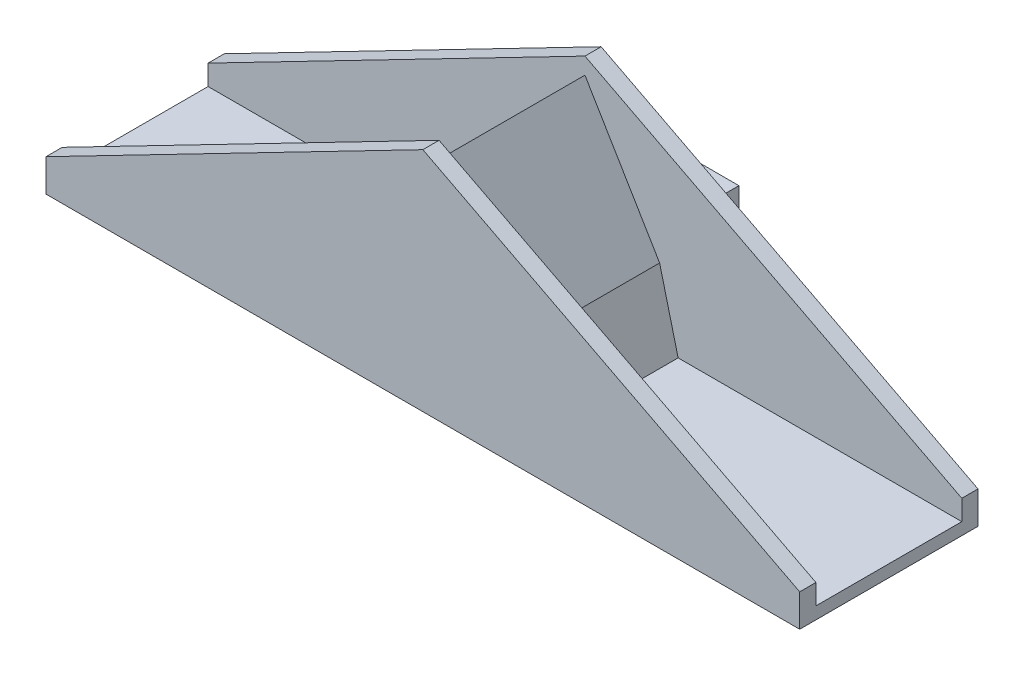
ISO-10303-21;
HEADER;
FILE_DESCRIPTION(('STEP AP214'),'2;1');
FILE_NAME('part.step','',(''),(''),'','','');
FILE_SCHEMA(('AUTOMOTIVE_DESIGN { 1 0 10303 214 1 1 1 1 }'));
ENDSEC;
DATA;
#1=APPLICATION_CONTEXT('core data for automotive mechanical design processes');
#2=APPLICATION_PROTOCOL_DEFINITION('international standard','automotive_design',2000,#1);
#3=PRODUCT_CONTEXT('',#1,'mechanical');
#4=PRODUCT('Part','Part','',(#3));
#5=PRODUCT_RELATED_PRODUCT_CATEGORY('part','',(#4));
#6=PRODUCT_DEFINITION_FORMATION('','',#4);
#7=PRODUCT_DEFINITION_CONTEXT('part definition',#1,'design');
#8=PRODUCT_DEFINITION('design','',#6,#7);
#9=PRODUCT_DEFINITION_SHAPE('','',#8);
#10=(LENGTH_UNIT() NAMED_UNIT(*) SI_UNIT(.MILLI.,.METRE.));
#11=(NAMED_UNIT(*) PLANE_ANGLE_UNIT() SI_UNIT($,.RADIAN.));
#12=(NAMED_UNIT(*) SI_UNIT($,.STERADIAN.) SOLID_ANGLE_UNIT());
#13=UNCERTAINTY_MEASURE_WITH_UNIT(LENGTH_MEASURE(1.E-05),#10,'distance_accuracy_value','');
#14=(GEOMETRIC_REPRESENTATION_CONTEXT(3) GLOBAL_UNCERTAINTY_ASSIGNED_CONTEXT((#13)) GLOBAL_UNIT_ASSIGNED_CONTEXT((#10,
#11,#12)) REPRESENTATION_CONTEXT('',''));
#15=CARTESIAN_POINT('',(0.,0.,0.));
#16=DIRECTION('',(0.,0.,1.));
#17=DIRECTION('',(1.,0.,0.));
#18=AXIS2_PLACEMENT_3D('',#15,#16,#17);
#19=CARTESIAN_POINT('',(26.7708980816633,7.03937851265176,-21.));
#20=DIRECTION('',(-1.,0.,0.));
#21=DIRECTION('',(0.,0.,1.));
#22=AXIS2_PLACEMENT_3D('',#19,#20,#21);
#23=CYLINDRICAL_SURFACE('',#22,1.);
#24=DIRECTION('',(-1.,0.,0.));
#25=VECTOR('',#24,1.);
#26=CARTESIAN_POINT('',(0.,7.03937851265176,-20.));
#27=LINE('',#26,#25);
#28=CARTESIAN_POINT('',(24.7708980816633,7.03937851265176,-20.));
#29=VERTEX_POINT('',#28);
#30=CARTESIAN_POINT('',(27.7708980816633,7.03937851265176,-20.));
#31=VERTEX_POINT('',#30);
#32=EDGE_CURVE('E303',#29,#31,#27,.F.);
#33=ORIENTED_EDGE('',*,*,#32,.F.);
#34=CARTESIAN_POINT('',(24.7708980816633,7.03937851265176,-21.));
#35=DIRECTION('',(1.,0.,0.));
#36=DIRECTION('',(0.,0.,-1.));
#37=AXIS2_PLACEMENT_3D('',#34,#35,#36);
#38=CIRCLE('',#37,1.);
#39=CARTESIAN_POINT('',(24.7708980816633,8.03937851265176,-21.));
#40=VERTEX_POINT('',#39);
#41=EDGE_CURVE('E11',#29,#40,#38,.F.);
#42=ORIENTED_EDGE('',*,*,#41,.T.);
#43=DIRECTION('',(-1.,0.,0.));
#44=VECTOR('',#43,1.);
#45=CARTESIAN_POINT('',(26.7708980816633,8.03937851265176,-21.));
#46=LINE('',#45,#44);
#47=CARTESIAN_POINT('',(26.7708980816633,8.03937851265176,-21.));
#48=VERTEX_POINT('',#47);
#49=EDGE_CURVE('E310',#48,#40,#46,.T.);
#50=ORIENTED_EDGE('',*,*,#49,.F.);
#51=CARTESIAN_POINT('',(27.7708980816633,7.03937851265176,-21.));
#52=DIRECTION('',(-0.707106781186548,-0.707106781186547,0.));
#53=DIRECTION('',(0.707106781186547,-0.707106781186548,0.));
#54=AXIS2_PLACEMENT_3D('',#51,#52,#53);
#55=ELLIPSE('',#54,1.41421356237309,1.);
#56=EDGE_CURVE('E321',#48,#31,#55,.F.);
#57=ORIENTED_EDGE('',*,*,#56,.T.);
#58=EDGE_LOOP('',(#33,#42,#50,#57));
#59=FACE_BOUND('',#58,.T.);
#60=ADVANCED_FACE('F34',(#59),#23,.F.);
#61=CARTESIAN_POINT('',(0.,0.,-20.));
#62=DIRECTION('',(0.,0.,-1.));
#63=DIRECTION('',(-1.,0.,0.));
#64=AXIS2_PLACEMENT_3D('',#61,#62,#63);
#65=PLANE('',#64);
#66=DIRECTION('',(1.,0.,0.));
#67=VECTOR('',#66,1.);
#68=CARTESIAN_POINT('',(26.7708980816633,16.0393785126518,-20.));
#69=LINE('',#68,#67);
#70=CARTESIAN_POINT('',(24.7708980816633,16.0393785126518,-20.));
#71=VERTEX_POINT('',#70);
#72=CARTESIAN_POINT('',(27.7708980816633,16.0393785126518,-20.));
#73=VERTEX_POINT('',#72);
#74=EDGE_CURVE('E324',#71,#73,#69,.T.);
#75=ORIENTED_EDGE('',*,*,#74,.F.);
#76=DIRECTION('',(0.,1.,0.));
#77=VECTOR('',#76,1.);
#78=CARTESIAN_POINT('',(24.7708980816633,7.03937851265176,-20.));
#79=LINE('',#78,#77);
#80=EDGE_CURVE('E57',#29,#71,#79,.T.);
#81=ORIENTED_EDGE('',*,*,#80,.F.);
#82=ORIENTED_EDGE('',*,*,#32,.T.);
#83=DIRECTION('',(0.,-1.,0.));
#84=VECTOR('',#83,1.);
#85=CARTESIAN_POINT('',(27.7708980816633,0.,-20.));
#86=LINE('',#85,#84);
#87=EDGE_CURVE('E306',#31,#73,#86,.F.);
#88=ORIENTED_EDGE('',*,*,#87,.T.);
#89=EDGE_LOOP('',(#75,#81,#82,#88));
#90=FACE_BOUND('',#89,.T.);
#91=DIRECTION('',(0.,-1.,0.));
#92=VECTOR('',#91,1.);
#93=CARTESIAN_POINT('',(-33.7291019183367,-2.61627906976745,-20.));
#94=LINE('',#93,#92);
#95=CARTESIAN_POINT('',(-33.7291019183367,1.38372093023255,-20.));
#96=VERTEX_POINT('',#95);
#97=CARTESIAN_POINT('',(-33.7291019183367,-2.61627906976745,-20.));
#98=VERTEX_POINT('',#97);
#99=EDGE_CURVE('E350',#96,#98,#94,.T.);
#100=ORIENTED_EDGE('',*,*,#99,.F.);
#101=DIRECTION('',(-0.888620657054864,-0.458642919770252,0.));
#102=VECTOR('',#101,1.);
#103=CARTESIAN_POINT('',(-33.7291019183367,1.38372093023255,-20.));
#104=LINE('',#103,#102);
#105=CARTESIAN_POINT('',(12.7708980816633,25.3837209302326,-20.));
#106=VERTEX_POINT('',#105);
#107=EDGE_CURVE('E355',#106,#96,#104,.T.);
#108=ORIENTED_EDGE('',*,*,#107,.F.);
#109=DIRECTION('',(-0.888620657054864,0.458642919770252,0.));
#110=VECTOR('',#109,1.);
#111=CARTESIAN_POINT('',(59.2708980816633,1.38372093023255,-20.));
#112=LINE('',#111,#110);
#113=CARTESIAN_POINT('',(59.2708980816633,1.38372093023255,-20.));
#114=VERTEX_POINT('',#113);
#115=EDGE_CURVE('E373',#114,#106,#112,.T.);
#116=ORIENTED_EDGE('',*,*,#115,.F.);
#117=DIRECTION('',(0.,1.,0.));
#118=VECTOR('',#117,1.);
#119=CARTESIAN_POINT('',(59.2708980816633,-2.61627906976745,-20.));
#120=LINE('',#119,#118);
#121=CARTESIAN_POINT('',(59.2708980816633,-2.61627906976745,-20.));
#122=VERTEX_POINT('',#121);
#123=EDGE_CURVE('E371',#122,#114,#120,.T.);
#124=ORIENTED_EDGE('',*,*,#123,.F.);
#125=DIRECTION('',(1.,0.,0.));
#126=VECTOR('',#125,1.);
#127=CARTESIAN_POINT('',(-33.7291019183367,-2.61627906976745,-20.));
#128=LINE('',#127,#126);
#129=EDGE_CURVE('E368',#98,#122,#128,.T.);
#130=ORIENTED_EDGE('',*,*,#129,.F.);
#131=EDGE_LOOP('',(#100,#108,#116,#124,#130));
#132=FACE_BOUND('',#131,.T.);
#133=CARTESIAN_POINT('',(16.7708980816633,16.0393785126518,-20.));
#134=VERTEX_POINT('',#133);
#135=CARTESIAN_POINT('',(19.7708980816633,16.0393785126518,-20.));
#136=VERTEX_POINT('',#135);
#137=EDGE_CURVE('E329',#134,#136,#69,.T.);
#138=ORIENTED_EDGE('',*,*,#137,.F.);
#139=DIRECTION('',(0.,1.,0.));
#140=VECTOR('',#139,1.);
#141=CARTESIAN_POINT('',(16.7708980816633,0.,-20.));
#142=LINE('',#141,#140);
#143=CARTESIAN_POINT('',(16.7708980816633,7.03937851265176,-20.));
#144=VERTEX_POINT('',#143);
#145=EDGE_CURVE('E302',#134,#144,#142,.F.);
#146=ORIENTED_EDGE('',*,*,#145,.T.);
#147=CARTESIAN_POINT('',(19.7708980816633,7.03937851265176,-20.));
#148=VERTEX_POINT('',#147);
#149=EDGE_CURVE('E296',#144,#148,#27,.F.);
#150=ORIENTED_EDGE('',*,*,#149,.T.);
#151=DIRECTION('',(0.,1.,0.));
#152=VECTOR('',#151,1.);
#153=CARTESIAN_POINT('',(19.7708980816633,7.03937851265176,-20.));
#154=LINE('',#153,#152);
#155=EDGE_CURVE('E280',#148,#136,#154,.T.);
#156=ORIENTED_EDGE('',*,*,#155,.T.);
#157=EDGE_LOOP('',(#138,#146,#150,#156));
#158=FACE_BOUND('',#157,.T.);
#159=ADVANCED_FACE('F300',(#90,#132,#158),#65,.T.);
#160=CARTESIAN_POINT('',(-33.7291019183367,-2.61627906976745,2.));
#161=DIRECTION('',(0.,1.,0.));
#162=DIRECTION('',(0.,0.,1.));
#163=AXIS2_PLACEMENT_3D('',#160,#161,#162);
#164=PLANE('',#163);
#165=DIRECTION('',(0.,0.,1.));
#166=VECTOR('',#165,1.);
#167=CARTESIAN_POINT('',(12.2708980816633,-2.61627906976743,-9.));
#168=LINE('',#167,#166);
#169=CARTESIAN_POINT('',(12.2708980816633,-2.61627906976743,-18.));
#170=VERTEX_POINT('',#169);
#171=CARTESIAN_POINT('',(12.2708980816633,-2.61627906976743,0.));
#172=VERTEX_POINT('',#171);
#173=EDGE_CURVE('E468',#170,#172,#168,.T.);
#174=ORIENTED_EDGE('',*,*,#173,.F.);
#175=DIRECTION('',(1.,0.,0.));
#176=VECTOR('',#175,1.);
#177=CARTESIAN_POINT('',(-33.7291019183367,-2.61627906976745,-18.));
#178=LINE('',#177,#176);
#179=CARTESIAN_POINT('',(1.22750170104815,-2.61627906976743,-18.));
#180=VERTEX_POINT('',#179);
#181=EDGE_CURVE('E358',#180,#170,#178,.T.);
#182=ORIENTED_EDGE('',*,*,#181,.F.);
#183=DIRECTION('',(0.,0.,-1.));
#184=VECTOR('',#183,1.);
#185=CARTESIAN_POINT('',(1.2275017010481,-2.61627906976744,0.));
#186=LINE('',#185,#184);
#187=CARTESIAN_POINT('',(1.2275017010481,-2.61627906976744,0.));
#188=VERTEX_POINT('',#187);
#189=EDGE_CURVE('E488',#188,#180,#186,.T.);
#190=ORIENTED_EDGE('',*,*,#189,.F.);
#191=DIRECTION('',(-1.,0.,0.));
#192=VECTOR('',#191,1.);
#193=CARTESIAN_POINT('',(1.2275017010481,-2.61627906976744,0.));
#194=LINE('',#193,#192);
#195=EDGE_CURVE('E481',#172,#188,#194,.T.);
#196=ORIENTED_EDGE('',*,*,#195,.F.);
#197=EDGE_LOOP('',(#174,#182,#190,#196));
#198=FACE_BOUND('',#197,.T.);
#199=DIRECTION('',(0.,0.,-1.));
#200=VECTOR('',#199,1.);
#201=CARTESIAN_POINT('',(-33.7291019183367,-2.61627906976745,2.));
#202=LINE('',#201,#200);
#203=CARTESIAN_POINT('',(-33.7291019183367,-2.61627906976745,2.));
#204=VERTEX_POINT('',#203);
#205=EDGE_CURVE('E555',#204,#98,#202,.T.);
#206=ORIENTED_EDGE('',*,*,#205,.T.);
#207=ORIENTED_EDGE('',*,*,#129,.T.);
#208=DIRECTION('',(0.,0.,-1.));
#209=VECTOR('',#208,1.);
#210=CARTESIAN_POINT('',(59.2708980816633,-2.61627906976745,2.));
#211=LINE('',#210,#209);
#212=CARTESIAN_POINT('',(59.2708980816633,-2.61627906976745,2.));
#213=VERTEX_POINT('',#212);
#214=EDGE_CURVE('E553',#213,#122,#211,.T.);
#215=ORIENTED_EDGE('',*,*,#214,.F.);
#216=DIRECTION('',(1.,0.,0.));
#217=VECTOR('',#216,1.);
#218=CARTESIAN_POINT('',(-33.7291019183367,-2.61627906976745,2.));
#219=LINE('',#218,#217);
#220=EDGE_CURVE('E528',#204,#213,#219,.T.);
#221=ORIENTED_EDGE('',*,*,#220,.F.);
#222=EDGE_LOOP('',(#206,#207,#215,#221));
#223=FACE_BOUND('',#222,.T.);
#224=DIRECTION('',(0.,0.,-1.));
#225=VECTOR('',#224,1.);
#226=CARTESIAN_POINT('',(24.3142944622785,-2.61627906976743,0.));
#227=LINE('',#226,#225);
#228=CARTESIAN_POINT('',(24.3142944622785,-2.61627906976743,0.));
#229=VERTEX_POINT('',#228);
#230=CARTESIAN_POINT('',(24.3142944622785,-2.61627906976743,-18.));
#231=VERTEX_POINT('',#230);
#232=EDGE_CURVE('E487',#229,#231,#227,.T.);
#233=ORIENTED_EDGE('',*,*,#232,.T.);
#234=CARTESIAN_POINT('',(13.2708980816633,-2.61627906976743,-18.));
#235=VERTEX_POINT('',#234);
#236=EDGE_CURVE('E354',#235,#231,#178,.T.);
#237=ORIENTED_EDGE('',*,*,#236,.F.);
#238=DIRECTION('',(0.,0.,1.));
#239=VECTOR('',#238,1.);
#240=CARTESIAN_POINT('',(13.2708980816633,-2.61627906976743,-9.));
#241=LINE('',#240,#239);
#242=CARTESIAN_POINT('',(13.2708980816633,-2.61627906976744,0.));
#243=VERTEX_POINT('',#242);
#244=EDGE_CURVE('E471',#235,#243,#241,.T.);
#245=ORIENTED_EDGE('',*,*,#244,.T.);
#246=EDGE_CURVE('E482',#229,#243,#194,.T.);
#247=ORIENTED_EDGE('',*,*,#246,.F.);
#248=EDGE_LOOP('',(#233,#237,#245,#247));
#249=FACE_BOUND('',#248,.T.);
#250=ADVANCED_FACE('F606',(#198,#223,#249),#164,.F.);
#251=CARTESIAN_POINT('',(59.2708980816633,-1.11627906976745,-9.));
#252=DIRECTION('',(0.,-1.,0.));
#253=DIRECTION('',(0.,0.,-1.));
#254=AXIS2_PLACEMENT_3D('',#251,#252,#253);
#255=PLANE('',#254);
#256=DIRECTION('',(1.,0.,0.));
#257=VECTOR('',#256,1.);
#258=CARTESIAN_POINT('',(59.2708980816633,-1.11627906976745,-18.));
#259=LINE('',#258,#257);
#260=CARTESIAN_POINT('',(24.2708980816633,-1.11627906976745,-18.));
#261=VERTEX_POINT('',#260);
#262=CARTESIAN_POINT('',(59.2708980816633,-1.11627906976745,-18.));
#263=VERTEX_POINT('',#262);
#264=EDGE_CURVE('E425',#261,#263,#259,.T.);
#265=ORIENTED_EDGE('',*,*,#264,.F.);
#266=DIRECTION('',(0.,0.,1.));
#267=VECTOR('',#266,1.);
#268=CARTESIAN_POINT('',(24.2708980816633,-1.11627906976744,-9.));
#269=LINE('',#268,#267);
#270=CARTESIAN_POINT('',(24.2708980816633,-1.11627906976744,0.));
#271=VERTEX_POINT('',#270);
#272=EDGE_CURVE('E500',#261,#271,#269,.T.);
#273=ORIENTED_EDGE('',*,*,#272,.T.);
#274=DIRECTION('',(1.,0.,0.));
#275=VECTOR('',#274,1.);
#276=CARTESIAN_POINT('',(59.2708980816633,-1.11627906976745,0.));
#277=LINE('',#276,#275);
#278=CARTESIAN_POINT('',(59.2708980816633,-1.11627906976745,0.));
#279=VERTEX_POINT('',#278);
#280=EDGE_CURVE('E514',#271,#279,#277,.T.);
#281=ORIENTED_EDGE('',*,*,#280,.T.);
#282=DIRECTION('',(0.,0.,1.));
#283=VECTOR('',#282,1.);
#284=CARTESIAN_POINT('',(59.2708980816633,-1.11627906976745,-9.));
#285=LINE('',#284,#283);
#286=EDGE_CURVE('E518',#263,#279,#285,.T.);
#287=ORIENTED_EDGE('',*,*,#286,.F.);
#288=EDGE_LOOP('',(#265,#273,#281,#287));
#289=FACE_BOUND('',#288,.T.);
#290=ADVANCED_FACE('F705',(#289),#255,.F.);
#291=CARTESIAN_POINT('',(12.7708980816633,4.38372093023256,0.));
#292=DIRECTION('',(0.518518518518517,0.855066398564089,0.));
#293=DIRECTION('',(-0.85506639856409,0.518518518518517,0.));
#294=AXIS2_PLACEMENT_3D('',#291,#292,#293);
#295=PLANE('',#294);
#296=DIRECTION('',(0.,0.,1.));
#297=VECTOR('',#296,1.);
#298=CARTESIAN_POINT('',(13.7293815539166,3.80248954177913,0.));
#299=LINE('',#298,#297);
#300=CARTESIAN_POINT('',(13.7293815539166,3.80248954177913,-18.));
#301=VERTEX_POINT('',#300);
#302=CARTESIAN_POINT('',(13.7293815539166,3.80248954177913,0.));
#303=VERTEX_POINT('',#302);
#304=EDGE_CURVE('E474',#301,#303,#299,.T.);
#305=ORIENTED_EDGE('',*,*,#304,.F.);
#306=DIRECTION('',(0.85506639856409,-0.518518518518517,0.));
#307=VECTOR('',#306,1.);
#308=CARTESIAN_POINT('',(12.7708980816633,4.38372093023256,-18.));
#309=LINE('',#308,#307);
#310=EDGE_CURVE('E408',#301,#231,#309,.T.);
#311=ORIENTED_EDGE('',*,*,#310,.T.);
#312=ORIENTED_EDGE('',*,*,#232,.F.);
#313=DIRECTION('',(0.85506639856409,-0.518518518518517,0.));
#314=VECTOR('',#313,1.);
#315=CARTESIAN_POINT('',(12.7708980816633,4.38372093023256,0.));
#316=LINE('',#315,#314);
#317=EDGE_CURVE('E479',#303,#229,#316,.T.);
#318=ORIENTED_EDGE('',*,*,#317,.F.);
#319=EDGE_LOOP('',(#305,#311,#312,#318));
#320=FACE_BOUND('',#319,.T.);
#321=ADVANCED_FACE('F701',(#320),#295,.F.);
#322=CARTESIAN_POINT('',(12.7708980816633,4.38372093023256,0.));
#323=DIRECTION('',(-0.518518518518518,0.855066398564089,0.));
#324=DIRECTION('',(-0.855066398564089,-0.518518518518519,0.));
#325=AXIS2_PLACEMENT_3D('',#322,#323,#324);
#326=PLANE('',#325);
#327=DIRECTION('',(0.855066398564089,0.518518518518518,0.));
#328=VECTOR('',#327,1.);
#329=CARTESIAN_POINT('',(12.7708980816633,4.38372093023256,-18.));
#330=LINE('',#329,#328);
#331=CARTESIAN_POINT('',(11.81241460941,3.80248954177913,-18.));
#332=VERTEX_POINT('',#331);
#333=EDGE_CURVE('E410',#180,#332,#330,.T.);
#334=ORIENTED_EDGE('',*,*,#333,.T.);
#335=DIRECTION('',(0.,0.,-1.));
#336=VECTOR('',#335,1.);
#337=CARTESIAN_POINT('',(11.81241460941,3.80248954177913,0.));
#338=LINE('',#337,#336);
#339=CARTESIAN_POINT('',(11.81241460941,3.80248954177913,0.));
#340=VERTEX_POINT('',#339);
#341=EDGE_CURVE('E477',#340,#332,#338,.T.);
#342=ORIENTED_EDGE('',*,*,#341,.F.);
#343=DIRECTION('',(0.855066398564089,0.518518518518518,0.));
#344=VECTOR('',#343,1.);
#345=CARTESIAN_POINT('',(12.7708980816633,4.38372093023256,0.));
#346=LINE('',#345,#344);
#347=EDGE_CURVE('E484',#188,#340,#346,.T.);
#348=ORIENTED_EDGE('',*,*,#347,.F.);
#349=ORIENTED_EDGE('',*,*,#189,.T.);
#350=EDGE_LOOP('',(#334,#342,#348,#349));
#351=FACE_BOUND('',#350,.T.);
#352=ADVANCED_FACE('F697',(#351),#326,.F.);
#353=CARTESIAN_POINT('',(0.,0.,0.));
#354=DIRECTION('',(0.,0.,-1.));
#355=DIRECTION('',(-1.,0.,0.));
#356=AXIS2_PLACEMENT_3D('',#353,#354,#355);
#357=PLANE('',#356);
#358=ORIENTED_EDGE('',*,*,#347,.T.);
#359=DIRECTION('',(-0.0712470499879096,0.997458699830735,0.));
#360=VECTOR('',#359,1.);
#361=CARTESIAN_POINT('',(12.2708980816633,-2.61627906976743,0.));
#362=LINE('',#361,#360);
#363=EDGE_CURVE('E451',#172,#340,#362,.T.);
#364=ORIENTED_EDGE('',*,*,#363,.F.);
#365=ORIENTED_EDGE('',*,*,#195,.T.);
#366=EDGE_LOOP('',(#358,#364,#365));
#367=FACE_BOUND('',#366,.T.);
#368=ADVANCED_FACE('F693',(#367),#357,.T.);
#369=ORIENTED_EDGE('',*,*,#246,.T.);
#370=DIRECTION('',(0.0712470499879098,0.997458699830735,0.));
#371=VECTOR('',#370,1.);
#372=CARTESIAN_POINT('',(13.3894615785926,-0.956390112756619,0.));
#373=LINE('',#372,#371);
#374=EDGE_CURVE('E557',#243,#303,#373,.T.);
#375=ORIENTED_EDGE('',*,*,#374,.T.);
#376=ORIENTED_EDGE('',*,*,#317,.T.);
#377=EDGE_LOOP('',(#369,#375,#376));
#378=FACE_BOUND('',#377,.T.);
#379=ADVANCED_FACE('F696',(#378),#357,.T.);
#380=CARTESIAN_POINT('',(0.,0.,0.));
#381=DIRECTION('',(0.,0.,-1.));
#382=DIRECTION('',(-1.,0.,0.));
#383=AXIS2_PLACEMENT_3D('',#380,#381,#382);
#384=PLANE('',#383);
#385=DIRECTION('',(0.51195101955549,0.859014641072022,0.));
#386=VECTOR('',#385,1.);
#387=CARTESIAN_POINT('',(3.55577972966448,7.88372093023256,0.));
#388=LINE('',#387,#386);
#389=CARTESIAN_POINT('',(3.55577972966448,7.88372093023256,0.));
#390=VERTEX_POINT('',#389);
#391=CARTESIAN_POINT('',(12.7708980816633,23.345984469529,0.));
#392=VERTEX_POINT('',#391);
#393=EDGE_CURVE('E494',#390,#392,#388,.T.);
#394=ORIENTED_EDGE('',*,*,#393,.F.);
#395=DIRECTION('',(0.246069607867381,0.969252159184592,0.));
#396=VECTOR('',#395,1.);
#397=CARTESIAN_POINT('',(1.27089808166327,-1.11627906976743,0.));
#398=LINE('',#397,#396);
#399=CARTESIAN_POINT('',(1.27089808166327,-1.11627906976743,0.));
#400=VERTEX_POINT('',#399);
#401=EDGE_CURVE('E490',#400,#390,#398,.T.);
#402=ORIENTED_EDGE('',*,*,#401,.F.);
#403=CARTESIAN_POINT('',(-33.7291019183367,-1.11627906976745,0.));
#404=VERTEX_POINT('',#403);
#405=EDGE_CURVE('E515',#404,#400,#277,.T.);
#406=ORIENTED_EDGE('',*,*,#405,.F.);
#407=DIRECTION('',(0.,-1.,0.));
#408=VECTOR('',#407,1.);
#409=CARTESIAN_POINT('',(-33.7291019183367,-2.61627906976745,0.));
#410=LINE('',#409,#408);
#411=CARTESIAN_POINT('',(-33.7291019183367,1.38372093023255,0.));
#412=VERTEX_POINT('',#411);
#413=EDGE_CURVE('E524',#412,#404,#410,.T.);
#414=ORIENTED_EDGE('',*,*,#413,.F.);
#415=DIRECTION('',(-0.888620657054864,-0.458642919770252,0.));
#416=VECTOR('',#415,1.);
#417=CARTESIAN_POINT('',(-33.7291019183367,1.38372093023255,0.));
#418=LINE('',#417,#416);
#419=CARTESIAN_POINT('',(12.7708980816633,25.3837209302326,0.));
#420=VERTEX_POINT('',#419);
#421=EDGE_CURVE('E529',#420,#412,#418,.T.);
#422=ORIENTED_EDGE('',*,*,#421,.F.);
#423=DIRECTION('',(-0.888620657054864,0.458642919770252,0.));
#424=VECTOR('',#423,1.);
#425=CARTESIAN_POINT('',(59.2708980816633,1.38372093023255,0.));
#426=LINE('',#425,#424);
#427=CARTESIAN_POINT('',(59.2708980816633,1.38372093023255,0.));
#428=VERTEX_POINT('',#427);
#429=EDGE_CURVE('E542',#428,#420,#426,.T.);
#430=ORIENTED_EDGE('',*,*,#429,.F.);
#431=DIRECTION('',(0.,1.,0.));
#432=VECTOR('',#431,1.);
#433=CARTESIAN_POINT('',(59.2708980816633,-2.61627906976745,0.));
#434=LINE('',#433,#432);
#435=EDGE_CURVE('E540',#279,#428,#434,.T.);
#436=ORIENTED_EDGE('',*,*,#435,.F.);
#437=ORIENTED_EDGE('',*,*,#280,.F.);
#438=DIRECTION('',(0.246069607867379,-0.969252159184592,0.));
#439=VECTOR('',#438,1.);
#440=CARTESIAN_POINT('',(24.2708980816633,-1.11627906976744,0.));
#441=LINE('',#440,#439);
#442=CARTESIAN_POINT('',(21.9860164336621,7.88372093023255,0.));
#443=VERTEX_POINT('',#442);
#444=EDGE_CURVE('E498',#443,#271,#441,.T.);
#445=ORIENTED_EDGE('',*,*,#444,.F.);
#446=DIRECTION('',(0.511951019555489,-0.859014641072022,0.));
#447=VECTOR('',#446,1.);
#448=CARTESIAN_POINT('',(21.9860164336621,7.88372093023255,0.));
#449=LINE('',#448,#447);
#450=EDGE_CURVE('E496',#392,#443,#449,.T.);
#451=ORIENTED_EDGE('',*,*,#450,.F.);
#452=EDGE_LOOP('',(#394,#402,#406,#414,#422,#430,#436,#437,#445,#451));
#453=FACE_BOUND('',#452,.T.);
#454=ADVANCED_FACE('F727',(#453),#384,.T.);
#455=DIRECTION('',(0.,0.,1.));
#456=VECTOR('',#455,1.);
#457=CARTESIAN_POINT('',(1.27089808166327,-1.11627906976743,-9.));
#458=LINE('',#457,#456);
#459=CARTESIAN_POINT('',(1.27089808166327,-1.11627906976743,-18.));
#460=VERTEX_POINT('',#459);
#461=EDGE_CURVE('E512',#460,#400,#458,.T.);
#462=ORIENTED_EDGE('',*,*,#461,.F.);
#463=CARTESIAN_POINT('',(-33.7291019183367,-1.11627906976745,-18.));
#464=VERTEX_POINT('',#463);
#465=EDGE_CURVE('E426',#464,#460,#259,.T.);
#466=ORIENTED_EDGE('',*,*,#465,.F.);
#467=DIRECTION('',(0.,0.,1.));
#468=VECTOR('',#467,1.);
#469=CARTESIAN_POINT('',(-33.7291019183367,-1.11627906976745,-9.));
#470=LINE('',#469,#468);
#471=EDGE_CURVE('E521',#464,#404,#470,.T.);
#472=ORIENTED_EDGE('',*,*,#471,.T.);
#473=ORIENTED_EDGE('',*,*,#405,.T.);
#474=EDGE_LOOP('',(#462,#466,#472,#473));
#475=FACE_BOUND('',#474,.T.);
#476=ADVANCED_FACE('F723',(#475),#255,.F.);
#477=CARTESIAN_POINT('',(-33.7291019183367,-2.61627906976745,2.));
#478=DIRECTION('',(1.,0.,0.));
#479=DIRECTION('',(0.,0.,-1.));
#480=AXIS2_PLACEMENT_3D('',#477,#478,#479);
#481=PLANE('',#480);
#482=ORIENTED_EDGE('',*,*,#413,.T.);
#483=ORIENTED_EDGE('',*,*,#471,.F.);
#484=DIRECTION('',(0.,-1.,0.));
#485=VECTOR('',#484,1.);
#486=CARTESIAN_POINT('',(-33.7291019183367,-2.61627906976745,-18.));
#487=LINE('',#486,#485);
#488=CARTESIAN_POINT('',(-33.7291019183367,1.38372093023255,-18.));
#489=VERTEX_POINT('',#488);
#490=EDGE_CURVE('E351',#489,#464,#487,.T.);
#491=ORIENTED_EDGE('',*,*,#490,.F.);
#492=DIRECTION('',(0.,0.,-1.));
#493=VECTOR('',#492,1.);
#494=CARTESIAN_POINT('',(-33.7291019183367,1.38372093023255,-18.));
#495=LINE('',#494,#493);
#496=EDGE_CURVE('E365',#489,#96,#495,.T.);
#497=ORIENTED_EDGE('',*,*,#496,.T.);
#498=ORIENTED_EDGE('',*,*,#99,.T.);
#499=ORIENTED_EDGE('',*,*,#205,.F.);
#500=DIRECTION('',(0.,-1.,0.));
#501=VECTOR('',#500,1.);
#502=CARTESIAN_POINT('',(-33.7291019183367,-2.61627906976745,2.));
#503=LINE('',#502,#501);
#504=CARTESIAN_POINT('',(-33.7291019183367,1.38372093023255,2.));
#505=VERTEX_POINT('',#504);
#506=EDGE_CURVE('E525',#505,#204,#503,.T.);
#507=ORIENTED_EDGE('',*,*,#506,.F.);
#508=DIRECTION('',(0.,0.,-1.));
#509=VECTOR('',#508,1.);
#510=CARTESIAN_POINT('',(-33.7291019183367,1.38372093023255,2.));
#511=LINE('',#510,#509);
#512=EDGE_CURVE('E537',#505,#412,#511,.T.);
#513=ORIENTED_EDGE('',*,*,#512,.T.);
#514=EDGE_LOOP('',(#482,#483,#491,#497,#498,#499,#507,#513));
#515=FACE_BOUND('',#514,.T.);
#516=ADVANCED_FACE('F726',(#515),#481,.F.);
#517=CARTESIAN_POINT('',(59.2708980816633,-2.61627906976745,2.));
#518=DIRECTION('',(-1.,0.,0.));
#519=DIRECTION('',(0.,0.,1.));
#520=AXIS2_PLACEMENT_3D('',#517,#518,#519);
#521=PLANE('',#520);
#522=ORIENTED_EDGE('',*,*,#214,.T.);
#523=ORIENTED_EDGE('',*,*,#123,.T.);
#524=DIRECTION('',(0.,0.,-1.));
#525=VECTOR('',#524,1.);
#526=CARTESIAN_POINT('',(59.2708980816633,1.38372093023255,-18.));
#527=LINE('',#526,#525);
#528=CARTESIAN_POINT('',(59.2708980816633,1.38372093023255,-18.));
#529=VERTEX_POINT('',#528);
#530=EDGE_CURVE('E381',#529,#114,#527,.T.);
#531=ORIENTED_EDGE('',*,*,#530,.F.);
#532=DIRECTION('',(0.,1.,0.));
#533=VECTOR('',#532,1.);
#534=CARTESIAN_POINT('',(59.2708980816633,-2.61627906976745,-18.));
#535=LINE('',#534,#533);
#536=EDGE_CURVE('E359',#263,#529,#535,.T.);
#537=ORIENTED_EDGE('',*,*,#536,.F.);
#538=ORIENTED_EDGE('',*,*,#286,.T.);
#539=ORIENTED_EDGE('',*,*,#435,.T.);
#540=DIRECTION('',(0.,0.,-1.));
#541=VECTOR('',#540,1.);
#542=CARTESIAN_POINT('',(59.2708980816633,1.38372093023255,2.));
#543=LINE('',#542,#541);
#544=CARTESIAN_POINT('',(59.2708980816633,1.38372093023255,2.));
#545=VERTEX_POINT('',#544);
#546=EDGE_CURVE('E550',#545,#428,#543,.T.);
#547=ORIENTED_EDGE('',*,*,#546,.F.);
#548=DIRECTION('',(0.,1.,0.));
#549=VECTOR('',#548,1.);
#550=CARTESIAN_POINT('',(59.2708980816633,-2.61627906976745,2.));
#551=LINE('',#550,#549);
#552=EDGE_CURVE('E531',#213,#545,#551,.T.);
#553=ORIENTED_EDGE('',*,*,#552,.F.);
#554=EDGE_LOOP('',(#522,#523,#531,#537,#538,#539,#547,#553));
#555=FACE_BOUND('',#554,.T.);
#556=ADVANCED_FACE('F742',(#555),#521,.F.);
#557=CARTESIAN_POINT('',(59.2708980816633,1.38372093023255,2.));
#558=DIRECTION('',(-0.458642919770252,-0.888620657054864,0.));
#559=DIRECTION('',(0.888620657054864,-0.458642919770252,0.));
#560=AXIS2_PLACEMENT_3D('',#557,#558,#559);
#561=PLANE('',#560);
#562=ORIENTED_EDGE('',*,*,#429,.T.);
#563=DIRECTION('',(0.,0.,-1.));
#564=VECTOR('',#563,1.);
#565=CARTESIAN_POINT('',(12.7708980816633,25.3837209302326,2.));
#566=LINE('',#565,#564);
#567=CARTESIAN_POINT('',(12.7708980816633,25.3837209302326,2.));
#568=VERTEX_POINT('',#567);
#569=EDGE_CURVE('E547',#568,#420,#566,.T.);
#570=ORIENTED_EDGE('',*,*,#569,.F.);
#571=DIRECTION('',(-0.888620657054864,0.458642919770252,0.));
#572=VECTOR('',#571,1.);
#573=CARTESIAN_POINT('',(59.2708980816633,1.38372093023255,2.));
#574=LINE('',#573,#572);
#575=EDGE_CURVE('E533',#545,#568,#574,.T.);
#576=ORIENTED_EDGE('',*,*,#575,.F.);
#577=ORIENTED_EDGE('',*,*,#546,.T.);
#578=EDGE_LOOP('',(#562,#570,#576,#577));
#579=FACE_BOUND('',#578,.T.);
#580=ADVANCED_FACE('F738',(#579),#561,.F.);
#581=CARTESIAN_POINT('',(-33.7291019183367,1.38372093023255,2.));
#582=DIRECTION('',(0.458642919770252,-0.888620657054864,0.));
#583=DIRECTION('',(0.888620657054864,0.458642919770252,0.));
#584=AXIS2_PLACEMENT_3D('',#581,#582,#583);
#585=PLANE('',#584);
#586=ORIENTED_EDGE('',*,*,#421,.T.);
#587=ORIENTED_EDGE('',*,*,#512,.F.);
#588=DIRECTION('',(-0.888620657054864,-0.458642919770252,0.));
#589=VECTOR('',#588,1.);
#590=CARTESIAN_POINT('',(-33.7291019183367,1.38372093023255,2.));
#591=LINE('',#590,#589);
#592=EDGE_CURVE('E535',#568,#505,#591,.T.);
#593=ORIENTED_EDGE('',*,*,#592,.F.);
#594=ORIENTED_EDGE('',*,*,#569,.T.);
#595=EDGE_LOOP('',(#586,#587,#593,#594));
#596=FACE_BOUND('',#595,.T.);
#597=ADVANCED_FACE('F731',(#596),#585,.F.);
#598=CARTESIAN_POINT('',(0.,0.,2.));
#599=DIRECTION('',(0.,0.,-1.));
#600=DIRECTION('',(-1.,0.,0.));
#601=AXIS2_PLACEMENT_3D('',#598,#599,#600);
#602=PLANE('',#601);
#603=ORIENTED_EDGE('',*,*,#506,.T.);
#604=ORIENTED_EDGE('',*,*,#220,.T.);
#605=ORIENTED_EDGE('',*,*,#552,.T.);
#606=ORIENTED_EDGE('',*,*,#575,.T.);
#607=ORIENTED_EDGE('',*,*,#592,.T.);
#608=EDGE_LOOP('',(#603,#604,#605,#606,#607));
#609=FACE_BOUND('',#608,.T.);
#610=ADVANCED_FACE('F721',(#609),#602,.F.);
#611=CARTESIAN_POINT('',(1.27089808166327,-1.11627906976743,-9.));
#612=DIRECTION('',(0.969252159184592,-0.246069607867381,0.));
#613=DIRECTION('',(0.246069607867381,0.969252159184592,0.));
#614=AXIS2_PLACEMENT_3D('',#611,#612,#613);
#615=PLANE('',#614);
#616=ORIENTED_EDGE('',*,*,#401,.T.);
#617=DIRECTION('',(0.,0.,1.));
#618=VECTOR('',#617,1.);
#619=CARTESIAN_POINT('',(3.55577972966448,7.88372093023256,-9.));
#620=LINE('',#619,#618);
#621=CARTESIAN_POINT('',(3.55577972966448,7.88372093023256,-18.));
#622=VERTEX_POINT('',#621);
#623=EDGE_CURVE('E509',#622,#390,#620,.T.);
#624=ORIENTED_EDGE('',*,*,#623,.F.);
#625=DIRECTION('',(0.246069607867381,0.969252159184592,0.));
#626=VECTOR('',#625,1.);
#627=CARTESIAN_POINT('',(1.27089808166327,-1.11627906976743,-18.));
#628=LINE('',#627,#626);
#629=EDGE_CURVE('E422',#460,#622,#628,.T.);
#630=ORIENTED_EDGE('',*,*,#629,.F.);
#631=ORIENTED_EDGE('',*,*,#461,.T.);
#632=EDGE_LOOP('',(#616,#624,#630,#631));
#633=FACE_BOUND('',#632,.T.);
#634=ADVANCED_FACE('F717',(#633),#615,.F.);
#635=CARTESIAN_POINT('',(3.55577972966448,7.88372093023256,-9.));
#636=DIRECTION('',(0.859014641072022,-0.51195101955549,0.));
#637=DIRECTION('',(0.51195101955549,0.859014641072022,0.));
#638=AXIS2_PLACEMENT_3D('',#635,#636,#637);
#639=PLANE('',#638);
#640=ORIENTED_EDGE('',*,*,#393,.T.);
#641=DIRECTION('',(0.,0.,1.));
#642=VECTOR('',#641,1.);
#643=CARTESIAN_POINT('',(12.7708980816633,23.345984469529,-9.));
#644=LINE('',#643,#642);
#645=CARTESIAN_POINT('',(12.7708980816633,23.345984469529,-18.));
#646=VERTEX_POINT('',#645);
#647=EDGE_CURVE('E506',#646,#392,#644,.T.);
#648=ORIENTED_EDGE('',*,*,#647,.F.);
#649=DIRECTION('',(0.51195101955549,0.859014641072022,0.));
#650=VECTOR('',#649,1.);
#651=CARTESIAN_POINT('',(3.55577972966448,7.88372093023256,-18.));
#652=LINE('',#651,#650);
#653=EDGE_CURVE('E419',#622,#646,#652,.T.);
#654=ORIENTED_EDGE('',*,*,#653,.F.);
#655=ORIENTED_EDGE('',*,*,#623,.T.);
#656=EDGE_LOOP('',(#640,#648,#654,#655));
#657=FACE_BOUND('',#656,.T.);
#658=ADVANCED_FACE('F713',(#657),#639,.F.);
#659=CARTESIAN_POINT('',(21.9860164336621,7.88372093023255,-9.));
#660=DIRECTION('',(-0.859014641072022,-0.511951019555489,0.));
#661=DIRECTION('',(0.511951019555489,-0.859014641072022,0.));
#662=AXIS2_PLACEMENT_3D('',#659,#660,#661);
#663=PLANE('',#662);
#664=ORIENTED_EDGE('',*,*,#450,.T.);
#665=DIRECTION('',(0.,0.,1.));
#666=VECTOR('',#665,1.);
#667=CARTESIAN_POINT('',(21.9860164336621,7.88372093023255,-9.));
#668=LINE('',#667,#666);
#669=CARTESIAN_POINT('',(21.9860164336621,7.88372093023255,-18.));
#670=VERTEX_POINT('',#669);
#671=EDGE_CURVE('E503',#670,#443,#668,.T.);
#672=ORIENTED_EDGE('',*,*,#671,.F.);
#673=DIRECTION('',(0.511951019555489,-0.859014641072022,0.));
#674=VECTOR('',#673,1.);
#675=CARTESIAN_POINT('',(21.9860164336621,7.88372093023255,-18.));
#676=LINE('',#675,#674);
#677=EDGE_CURVE('E416',#646,#670,#676,.T.);
#678=ORIENTED_EDGE('',*,*,#677,.F.);
#679=ORIENTED_EDGE('',*,*,#647,.T.);
#680=EDGE_LOOP('',(#664,#672,#678,#679));
#681=FACE_BOUND('',#680,.T.);
#682=ADVANCED_FACE('F709',(#681),#663,.F.);
#683=CARTESIAN_POINT('',(24.2708980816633,-1.11627906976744,-9.));
#684=DIRECTION('',(-0.969252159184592,-0.246069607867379,0.));
#685=DIRECTION('',(0.246069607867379,-0.969252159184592,0.));
#686=AXIS2_PLACEMENT_3D('',#683,#684,#685);
#687=PLANE('',#686);
#688=ORIENTED_EDGE('',*,*,#444,.T.);
#689=ORIENTED_EDGE('',*,*,#272,.F.);
#690=DIRECTION('',(0.246069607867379,-0.969252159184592,0.));
#691=VECTOR('',#690,1.);
#692=CARTESIAN_POINT('',(24.2708980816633,-1.11627906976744,-18.));
#693=LINE('',#692,#691);
#694=EDGE_CURVE('E413',#670,#261,#693,.T.);
#695=ORIENTED_EDGE('',*,*,#694,.F.);
#696=ORIENTED_EDGE('',*,*,#671,.T.);
#697=EDGE_LOOP('',(#688,#689,#695,#696));
#698=FACE_BOUND('',#697,.T.);
#699=ADVANCED_FACE('F691',(#698),#687,.F.);
#700=CARTESIAN_POINT('',(12.2708980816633,-2.61627906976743,-9.));
#701=DIRECTION('',(0.997458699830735,0.0712470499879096,0.));
#702=DIRECTION('',(-0.0712470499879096,0.997458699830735,0.));
#703=AXIS2_PLACEMENT_3D('',#700,#701,#702);
#704=PLANE('',#703);
#705=ORIENTED_EDGE('',*,*,#363,.T.);
#706=ORIENTED_EDGE('',*,*,#341,.T.);
#707=DIRECTION('',(-0.0712470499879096,0.997458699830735,0.));
#708=VECTOR('',#707,1.);
#709=CARTESIAN_POINT('',(12.2708980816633,-2.61627906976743,-18.));
#710=LINE('',#709,#708);
#711=EDGE_CURVE('E402',#170,#332,#710,.T.);
#712=ORIENTED_EDGE('',*,*,#711,.F.);
#713=ORIENTED_EDGE('',*,*,#173,.T.);
#714=EDGE_LOOP('',(#705,#706,#712,#713));
#715=FACE_BOUND('',#714,.T.);
#716=ADVANCED_FACE('F687',(#715),#704,.F.);
#717=CARTESIAN_POINT('',(13.2708980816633,-2.61627906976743,-9.));
#718=DIRECTION('',(-0.997458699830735,0.0712470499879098,0.));
#719=DIRECTION('',(-0.0712470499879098,-0.997458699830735,0.));
#720=AXIS2_PLACEMENT_3D('',#717,#718,#719);
#721=PLANE('',#720);
#722=ORIENTED_EDGE('',*,*,#244,.F.);
#723=DIRECTION('',(-0.0712470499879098,-0.997458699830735,0.));
#724=VECTOR('',#723,1.);
#725=CARTESIAN_POINT('',(13.2708980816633,-2.61627906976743,-18.));
#726=LINE('',#725,#724);
#727=EDGE_CURVE('E405',#301,#235,#726,.T.);
#728=ORIENTED_EDGE('',*,*,#727,.F.);
#729=ORIENTED_EDGE('',*,*,#304,.T.);
#730=ORIENTED_EDGE('',*,*,#374,.F.);
#731=EDGE_LOOP('',(#722,#728,#729,#730));
#732=FACE_BOUND('',#731,.T.);
#733=ADVANCED_FACE('F684',(#732),#721,.F.);
#734=CARTESIAN_POINT('',(0.,0.,-18.));
#735=DIRECTION('',(0.,0.,-1.));
#736=DIRECTION('',(-1.,0.,0.));
#737=AXIS2_PLACEMENT_3D('',#734,#735,#736);
#738=PLANE('',#737);
#739=ORIENTED_EDGE('',*,*,#181,.T.);
#740=ORIENTED_EDGE('',*,*,#711,.T.);
#741=ORIENTED_EDGE('',*,*,#333,.F.);
#742=EDGE_LOOP('',(#739,#740,#741));
#743=FACE_BOUND('',#742,.T.);
#744=ADVANCED_FACE('F646',(#743),#738,.F.);
#745=ORIENTED_EDGE('',*,*,#490,.T.);
#746=ORIENTED_EDGE('',*,*,#465,.T.);
#747=ORIENTED_EDGE('',*,*,#629,.T.);
#748=ORIENTED_EDGE('',*,*,#653,.T.);
#749=ORIENTED_EDGE('',*,*,#677,.T.);
#750=ORIENTED_EDGE('',*,*,#694,.T.);
#751=ORIENTED_EDGE('',*,*,#264,.T.);
#752=ORIENTED_EDGE('',*,*,#536,.T.);
#753=DIRECTION('',(-0.888620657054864,0.458642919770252,0.));
#754=VECTOR('',#753,1.);
#755=CARTESIAN_POINT('',(59.2708980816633,1.38372093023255,-18.));
#756=LINE('',#755,#754);
#757=CARTESIAN_POINT('',(12.7708980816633,25.3837209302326,-18.));
#758=VERTEX_POINT('',#757);
#759=EDGE_CURVE('E361',#529,#758,#756,.T.);
#760=ORIENTED_EDGE('',*,*,#759,.T.);
#761=DIRECTION('',(-0.888620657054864,-0.458642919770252,0.));
#762=VECTOR('',#761,1.);
#763=CARTESIAN_POINT('',(-33.7291019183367,1.38372093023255,-18.));
#764=LINE('',#763,#762);
#765=EDGE_CURVE('E363',#758,#489,#764,.T.);
#766=ORIENTED_EDGE('',*,*,#765,.T.);
#767=EDGE_LOOP('',(#745,#746,#747,#748,#749,#750,#751,#752,#760,#766));
#768=FACE_BOUND('',#767,.T.);
#769=ADVANCED_FACE('F761',(#768),#738,.F.);
#770=ORIENTED_EDGE('',*,*,#310,.F.);
#771=ORIENTED_EDGE('',*,*,#727,.T.);
#772=ORIENTED_EDGE('',*,*,#236,.T.);
#773=EDGE_LOOP('',(#770,#771,#772));
#774=FACE_BOUND('',#773,.T.);
#775=ADVANCED_FACE('F647',(#774),#738,.F.);
#776=CARTESIAN_POINT('',(59.2708980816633,1.38372093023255,-18.));
#777=DIRECTION('',(-0.458642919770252,-0.888620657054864,0.));
#778=DIRECTION('',(0.888620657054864,-0.458642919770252,0.));
#779=AXIS2_PLACEMENT_3D('',#776,#777,#778);
#780=PLANE('',#779);
#781=ORIENTED_EDGE('',*,*,#115,.T.);
#782=DIRECTION('',(0.,0.,-1.));
#783=VECTOR('',#782,1.);
#784=CARTESIAN_POINT('',(12.7708980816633,25.3837209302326,-18.));
#785=LINE('',#784,#783);
#786=EDGE_CURVE('E378',#758,#106,#785,.T.);
#787=ORIENTED_EDGE('',*,*,#786,.F.);
#788=ORIENTED_EDGE('',*,*,#759,.F.);
#789=ORIENTED_EDGE('',*,*,#530,.T.);
#790=EDGE_LOOP('',(#781,#787,#788,#789));
#791=FACE_BOUND('',#790,.T.);
#792=ADVANCED_FACE('F652',(#791),#780,.F.);
#793=CARTESIAN_POINT('',(-33.7291019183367,1.38372093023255,-18.));
#794=DIRECTION('',(0.458642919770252,-0.888620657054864,0.));
#795=DIRECTION('',(0.888620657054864,0.458642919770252,0.));
#796=AXIS2_PLACEMENT_3D('',#793,#794,#795);
#797=PLANE('',#796);
#798=ORIENTED_EDGE('',*,*,#107,.T.);
#799=ORIENTED_EDGE('',*,*,#496,.F.);
#800=ORIENTED_EDGE('',*,*,#765,.F.);
#801=ORIENTED_EDGE('',*,*,#786,.T.);
#802=EDGE_LOOP('',(#798,#799,#800,#801));
#803=FACE_BOUND('',#802,.T.);
#804=ADVANCED_FACE('F641',(#803),#797,.F.);
#805=CARTESIAN_POINT('',(26.7708980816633,16.0393785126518,-23.));
#806=DIRECTION('',(-1.,0.,0.));
#807=DIRECTION('',(0.,-1.,0.));
#808=AXIS2_PLACEMENT_3D('',#805,#806,#807);
#809=PLANE('',#808);
#810=DIRECTION('',(0.,0.,1.));
#811=VECTOR('',#810,1.);
#812=CARTESIAN_POINT('',(26.7708980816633,16.0393785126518,-23.));
#813=LINE('',#812,#811);
#814=CARTESIAN_POINT('',(26.7708980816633,16.0393785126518,-23.));
#815=VERTEX_POINT('',#814);
#816=CARTESIAN_POINT('',(26.7708980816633,16.0393785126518,-21.));
#817=VERTEX_POINT('',#816);
#818=EDGE_CURVE('E338',#815,#817,#813,.T.);
#819=ORIENTED_EDGE('',*,*,#818,.T.);
#820=DIRECTION('',(0.,-1.,0.));
#821=VECTOR('',#820,1.);
#822=CARTESIAN_POINT('',(26.7708980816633,16.0393785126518,-21.));
#823=LINE('',#822,#821);
#824=EDGE_CURVE('E313',#817,#48,#823,.T.);
#825=ORIENTED_EDGE('',*,*,#824,.T.);
#826=DIRECTION('',(0.,0.,1.));
#827=VECTOR('',#826,1.);
#828=CARTESIAN_POINT('',(26.7708980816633,8.03937851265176,-23.));
#829=LINE('',#828,#827);
#830=CARTESIAN_POINT('',(26.7708980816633,8.03937851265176,-23.));
#831=VERTEX_POINT('',#830);
#832=EDGE_CURVE('E347',#831,#48,#829,.T.);
#833=ORIENTED_EDGE('',*,*,#832,.F.);
#834=DIRECTION('',(0.,-1.,0.));
#835=VECTOR('',#834,1.);
#836=CARTESIAN_POINT('',(26.7708980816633,16.0393785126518,-23.));
#837=LINE('',#836,#835);
#838=EDGE_CURVE('E333',#815,#831,#837,.T.);
#839=ORIENTED_EDGE('',*,*,#838,.F.);
#840=EDGE_LOOP('',(#819,#825,#833,#839));
#841=FACE_BOUND('',#840,.T.);
#842=ADVANCED_FACE('F574',(#841),#809,.F.);
#843=CARTESIAN_POINT('',(26.7708980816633,8.03937851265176,-23.));
#844=DIRECTION('',(0.,1.,0.));
#845=DIRECTION('',(0.,0.,1.));
#846=AXIS2_PLACEMENT_3D('',#843,#844,#845);
#847=PLANE('',#846);
#848=ORIENTED_EDGE('',*,*,#49,.T.);
#849=DIRECTION('',(0.,0.,-1.));
#850=VECTOR('',#849,1.);
#851=CARTESIAN_POINT('',(24.7708980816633,8.03937851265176,-23.));
#852=LINE('',#851,#850);
#853=CARTESIAN_POINT('',(24.7708980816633,8.03937851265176,-22.));
#854=VERTEX_POINT('',#853);
#855=EDGE_CURVE('E611',#40,#854,#852,.T.);
#856=ORIENTED_EDGE('',*,*,#855,.T.);
#857=DIRECTION('',(-1.,0.,0.));
#858=VECTOR('',#857,1.);
#859=CARTESIAN_POINT('',(26.7708980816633,8.03937851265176,-22.));
#860=LINE('',#859,#858);
#861=CARTESIAN_POINT('',(19.7708980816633,8.03937851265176,-22.));
#862=VERTEX_POINT('',#861);
#863=EDGE_CURVE('E322',#854,#862,#860,.T.);
#864=ORIENTED_EDGE('',*,*,#863,.T.);
#865=DIRECTION('',(0.,0.,1.));
#866=VECTOR('',#865,1.);
#867=CARTESIAN_POINT('',(19.7708980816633,8.03937851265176,-23.));
#868=LINE('',#867,#866);
#869=CARTESIAN_POINT('',(19.7708980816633,8.03937851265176,-21.));
#870=VERTEX_POINT('',#869);
#871=EDGE_CURVE('E612',#862,#870,#868,.T.);
#872=ORIENTED_EDGE('',*,*,#871,.T.);
#873=CARTESIAN_POINT('',(17.7708980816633,8.03937851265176,-21.));
#874=VERTEX_POINT('',#873);
#875=EDGE_CURVE('E298',#870,#874,#46,.T.);
#876=ORIENTED_EDGE('',*,*,#875,.T.);
#877=DIRECTION('',(0.,0.,1.));
#878=VECTOR('',#877,1.);
#879=CARTESIAN_POINT('',(17.7708980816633,8.03937851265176,-23.));
#880=LINE('',#879,#878);
#881=CARTESIAN_POINT('',(17.7708980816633,8.03937851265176,-23.));
#882=VERTEX_POINT('',#881);
#883=EDGE_CURVE('E344',#882,#874,#880,.T.);
#884=ORIENTED_EDGE('',*,*,#883,.F.);
#885=DIRECTION('',(-1.,0.,0.));
#886=VECTOR('',#885,1.);
#887=CARTESIAN_POINT('',(26.7708980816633,8.03937851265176,-23.));
#888=LINE('',#887,#886);
#889=EDGE_CURVE('E578',#831,#882,#888,.T.);
#890=ORIENTED_EDGE('',*,*,#889,.F.);
#891=ORIENTED_EDGE('',*,*,#832,.T.);
#892=EDGE_LOOP('',(#848,#856,#864,#872,#876,#884,#890,#891));
#893=FACE_BOUND('',#892,.T.);
#894=ADVANCED_FACE('F609',(#893),#847,.F.);
#895=CARTESIAN_POINT('',(17.7708980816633,16.0393785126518,-23.));
#896=DIRECTION('',(1.,0.,0.));
#897=DIRECTION('',(0.,0.,-1.));
#898=AXIS2_PLACEMENT_3D('',#895,#896,#897);
#899=PLANE('',#898);
#900=ORIENTED_EDGE('',*,*,#883,.T.);
#901=DIRECTION('',(0.,1.,0.));
#902=VECTOR('',#901,1.);
#903=CARTESIAN_POINT('',(17.7708980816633,16.0393785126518,-21.));
#904=LINE('',#903,#902);
#905=CARTESIAN_POINT('',(17.7708980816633,16.0393785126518,-21.));
#906=VERTEX_POINT('',#905);
#907=EDGE_CURVE('E558',#874,#906,#904,.T.);
#908=ORIENTED_EDGE('',*,*,#907,.T.);
#909=DIRECTION('',(0.,0.,1.));
#910=VECTOR('',#909,1.);
#911=CARTESIAN_POINT('',(17.7708980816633,16.0393785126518,-23.));
#912=LINE('',#911,#910);
#913=CARTESIAN_POINT('',(17.7708980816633,16.0393785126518,-23.));
#914=VERTEX_POINT('',#913);
#915=EDGE_CURVE('E341',#914,#906,#912,.T.);
#916=ORIENTED_EDGE('',*,*,#915,.F.);
#917=DIRECTION('',(0.,1.,0.));
#918=VECTOR('',#917,1.);
#919=CARTESIAN_POINT('',(17.7708980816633,16.0393785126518,-23.));
#920=LINE('',#919,#918);
#921=EDGE_CURVE('E580',#882,#914,#920,.T.);
#922=ORIENTED_EDGE('',*,*,#921,.F.);
#923=EDGE_LOOP('',(#900,#908,#916,#922));
#924=FACE_BOUND('',#923,.T.);
#925=ADVANCED_FACE('F586',(#924),#899,.F.);
#926=CARTESIAN_POINT('',(26.7708980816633,16.0393785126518,-23.));
#927=DIRECTION('',(0.,-1.,0.));
#928=DIRECTION('',(0.,0.,-1.));
#929=AXIS2_PLACEMENT_3D('',#926,#927,#928);
#930=PLANE('',#929);
#931=DIRECTION('',(-1.,0.,0.));
#932=VECTOR('',#931,1.);
#933=CARTESIAN_POINT('',(24.7708980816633,16.0393785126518,-22.));
#934=LINE('',#933,#932);
#935=CARTESIAN_POINT('',(24.7708980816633,16.0393785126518,-22.));
#936=VERTEX_POINT('',#935);
#937=CARTESIAN_POINT('',(19.7708980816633,16.0393785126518,-22.));
#938=VERTEX_POINT('',#937);
#939=EDGE_CURVE('E620',#936,#938,#934,.T.);
#940=ORIENTED_EDGE('',*,*,#939,.F.);
#941=DIRECTION('',(0.,0.,-1.));
#942=VECTOR('',#941,1.);
#943=CARTESIAN_POINT('',(24.7708980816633,16.0393785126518,-20.));
#944=LINE('',#943,#942);
#945=EDGE_CURVE('E50',#71,#936,#944,.T.);
#946=ORIENTED_EDGE('',*,*,#945,.F.);
#947=ORIENTED_EDGE('',*,*,#74,.T.);
#948=CARTESIAN_POINT('',(27.7708980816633,16.0393785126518,-21.));
#949=DIRECTION('',(0.,-1.,0.));
#950=DIRECTION('',(0.,0.,-1.));
#951=AXIS2_PLACEMENT_3D('',#948,#949,#950);
#952=CIRCLE('',#951,1.);
#953=EDGE_CURVE('E299',#73,#817,#952,.T.);
#954=ORIENTED_EDGE('',*,*,#953,.T.);
#955=ORIENTED_EDGE('',*,*,#818,.F.);
#956=DIRECTION('',(1.,0.,0.));
#957=VECTOR('',#956,1.);
#958=CARTESIAN_POINT('',(26.7708980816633,16.0393785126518,-23.));
#959=LINE('',#958,#957);
#960=EDGE_CURVE('E336',#914,#815,#959,.T.);
#961=ORIENTED_EDGE('',*,*,#960,.F.);
#962=ORIENTED_EDGE('',*,*,#915,.T.);
#963=CARTESIAN_POINT('',(16.7708980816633,16.0393785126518,-21.));
#964=DIRECTION('',(0.,-1.,0.));
#965=DIRECTION('',(0.,0.,-1.));
#966=AXIS2_PLACEMENT_3D('',#963,#964,#965);
#967=CIRCLE('',#966,1.);
#968=EDGE_CURVE('E315',#906,#134,#967,.T.);
#969=ORIENTED_EDGE('',*,*,#968,.T.);
#970=ORIENTED_EDGE('',*,*,#137,.T.);
#971=DIRECTION('',(0.,0.,1.));
#972=VECTOR('',#971,1.);
#973=CARTESIAN_POINT('',(19.7708980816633,16.0393785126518,-20.));
#974=LINE('',#973,#972);
#975=EDGE_CURVE('E285',#938,#136,#974,.T.);
#976=ORIENTED_EDGE('',*,*,#975,.F.);
#977=EDGE_LOOP('',(#940,#946,#947,#954,#955,#961,#962,#969,#970,#976));
#978=FACE_BOUND('',#977,.T.);
#979=ADVANCED_FACE('F570',(#978),#930,.F.);
#980=CARTESIAN_POINT('',(0.,0.,-23.));
#981=DIRECTION('',(0.,0.,-1.));
#982=DIRECTION('',(-1.,0.,0.));
#983=AXIS2_PLACEMENT_3D('',#980,#981,#982);
#984=PLANE('',#983);
#985=ORIENTED_EDGE('',*,*,#838,.T.);
#986=ORIENTED_EDGE('',*,*,#889,.T.);
#987=ORIENTED_EDGE('',*,*,#921,.T.);
#988=ORIENTED_EDGE('',*,*,#960,.T.);
#989=EDGE_LOOP('',(#985,#986,#987,#988));
#990=FACE_BOUND('',#989,.T.);
#991=ADVANCED_FACE('F585',(#990),#984,.T.);
#992=CARTESIAN_POINT('',(27.7708980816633,16.0393785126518,-21.));
#993=DIRECTION('',(0.,-1.,0.));
#994=DIRECTION('',(1.,0.,0.));
#995=AXIS2_PLACEMENT_3D('',#992,#993,#994);
#996=CYLINDRICAL_SURFACE('',#995,1.);
#997=ORIENTED_EDGE('',*,*,#953,.F.);
#998=ORIENTED_EDGE('',*,*,#87,.F.);
#999=ORIENTED_EDGE('',*,*,#56,.F.);
#1000=ORIENTED_EDGE('',*,*,#824,.F.);
#1001=EDGE_LOOP('',(#997,#998,#999,#1000));
#1002=FACE_BOUND('',#1001,.T.);
#1003=ADVANCED_FACE('F36',(#1002),#996,.F.);
#1004=ORIENTED_EDGE('',*,*,#875,.F.);
#1005=CARTESIAN_POINT('',(19.7708980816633,7.03937851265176,-21.));
#1006=DIRECTION('',(-1.,0.,0.));
#1007=DIRECTION('',(0.,0.,1.));
#1008=AXIS2_PLACEMENT_3D('',#1005,#1006,#1007);
#1009=CIRCLE('',#1008,1.);
#1010=EDGE_CURVE('E43',#870,#148,#1009,.F.);
#1011=ORIENTED_EDGE('',*,*,#1010,.T.);
#1012=ORIENTED_EDGE('',*,*,#149,.F.);
#1013=CARTESIAN_POINT('',(16.7708980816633,7.03937851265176,-21.));
#1014=DIRECTION('',(-0.707106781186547,0.707106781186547,0.));
#1015=DIRECTION('',(-0.707106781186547,-0.707106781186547,0.));
#1016=AXIS2_PLACEMENT_3D('',#1013,#1014,#1015);
#1017=ELLIPSE('',#1016,1.41421356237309,1.);
#1018=EDGE_CURVE('E319',#874,#144,#1017,.F.);
#1019=ORIENTED_EDGE('',*,*,#1018,.F.);
#1020=EDGE_LOOP('',(#1004,#1011,#1012,#1019));
#1021=FACE_BOUND('',#1020,.T.);
#1022=ADVANCED_FACE('F294',(#1021),#23,.F.);
#1023=CARTESIAN_POINT('',(16.7708980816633,16.0393785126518,-21.));
#1024=DIRECTION('',(0.,1.,0.));
#1025=DIRECTION('',(0.,0.,1.));
#1026=AXIS2_PLACEMENT_3D('',#1023,#1024,#1025);
#1027=CYLINDRICAL_SURFACE('',#1026,1.);
#1028=ORIENTED_EDGE('',*,*,#1018,.T.);
#1029=ORIENTED_EDGE('',*,*,#145,.F.);
#1030=ORIENTED_EDGE('',*,*,#968,.F.);
#1031=ORIENTED_EDGE('',*,*,#907,.F.);
#1032=EDGE_LOOP('',(#1028,#1029,#1030,#1031));
#1033=FACE_BOUND('',#1032,.T.);
#1034=ADVANCED_FACE('F590',(#1033),#1027,.F.);
#1035=CARTESIAN_POINT('',(24.7708980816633,7.03937851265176,-22.));
#1036=DIRECTION('',(0.,0.,-1.));
#1037=DIRECTION('',(-1.,0.,0.));
#1038=AXIS2_PLACEMENT_3D('',#1035,#1036,#1037);
#1039=PLANE('',#1038);
#1040=DIRECTION('',(0.,1.,0.));
#1041=VECTOR('',#1040,1.);
#1042=CARTESIAN_POINT('',(24.7708980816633,7.03937851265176,-22.));
#1043=LINE('',#1042,#1041);
#1044=EDGE_CURVE('E615',#854,#936,#1043,.T.);
#1045=ORIENTED_EDGE('',*,*,#1044,.T.);
#1046=ORIENTED_EDGE('',*,*,#939,.T.);
#1047=DIRECTION('',(0.,1.,0.));
#1048=VECTOR('',#1047,1.);
#1049=CARTESIAN_POINT('',(19.7708980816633,7.03937851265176,-22.));
#1050=LINE('',#1049,#1048);
#1051=EDGE_CURVE('E289',#862,#938,#1050,.T.);
#1052=ORIENTED_EDGE('',*,*,#1051,.F.);
#1053=ORIENTED_EDGE('',*,*,#863,.F.);
#1054=EDGE_LOOP('',(#1045,#1046,#1052,#1053));
#1055=FACE_BOUND('',#1054,.T.);
#1056=ADVANCED_FACE('F592',(#1055),#1039,.F.);
#1057=CARTESIAN_POINT('',(24.7708980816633,7.03937851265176,-20.));
#1058=DIRECTION('',(1.,0.,0.));
#1059=DIRECTION('',(0.,0.,-1.));
#1060=AXIS2_PLACEMENT_3D('',#1057,#1058,#1059);
#1061=PLANE('',#1060);
#1062=ORIENTED_EDGE('',*,*,#41,.F.);
#1063=ORIENTED_EDGE('',*,*,#80,.T.);
#1064=ORIENTED_EDGE('',*,*,#945,.T.);
#1065=ORIENTED_EDGE('',*,*,#1044,.F.);
#1066=ORIENTED_EDGE('',*,*,#855,.F.);
#1067=EDGE_LOOP('',(#1062,#1063,#1064,#1065,#1066));
#1068=FACE_BOUND('',#1067,.T.);
#1069=ADVANCED_FACE('F598',(#1068),#1061,.F.);
#1070=CARTESIAN_POINT('',(19.7708980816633,7.03937851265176,-20.));
#1071=DIRECTION('',(-1.,0.,0.));
#1072=DIRECTION('',(0.,0.,1.));
#1073=AXIS2_PLACEMENT_3D('',#1070,#1071,#1072);
#1074=PLANE('',#1073);
#1075=ORIENTED_EDGE('',*,*,#1051,.T.);
#1076=ORIENTED_EDGE('',*,*,#975,.T.);
#1077=ORIENTED_EDGE('',*,*,#155,.F.);
#1078=ORIENTED_EDGE('',*,*,#1010,.F.);
#1079=ORIENTED_EDGE('',*,*,#871,.F.);
#1080=EDGE_LOOP('',(#1075,#1076,#1077,#1078,#1079));
#1081=FACE_BOUND('',#1080,.T.);
#1082=ADVANCED_FACE('F282',(#1081),#1074,.F.);
#1083=CLOSED_SHELL('',(#60,#159,#250,#290,#321,#352,#368,#379,#454,#476,#516,#556,#580,#597,
#610,#634,#658,#682,#699,#716,#733,#744,#769,#775,#792,#804,#842,#894,#925,#979,#991,#1003,
#1022,#1034,#1056,#1069,#1082));
#1084=CARTESIAN_POINT('',(0.,0.,0.));
#1085=DIRECTION('',(0.,0.,-1.));
#1086=DIRECTION('',(-1.,0.,0.));
#1087=AXIS2_PLACEMENT_3D('',#1084,#1085,#1086);
#1088=PLANE('',#1087);
#1089=DIRECTION('',(0.511951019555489,0.859014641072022,0.));
#1090=VECTOR('',#1089,1.);
#1091=CARTESIAN_POINT('',(12.7708980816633,21.3926726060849,0.));
#1092=LINE('',#1091,#1090);
#1093=CARTESIAN_POINT('',(4.48924644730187,7.49669479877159,0.));
#1094=VERTEX_POINT('',#1093);
#1095=CARTESIAN_POINT('',(12.7708980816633,21.3926726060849,0.));
#1096=VERTEX_POINT('',#1095);
#1097=EDGE_CURVE('E429',#1094,#1096,#1092,.T.);
#1098=ORIENTED_EDGE('',*,*,#1097,.T.);
#1099=DIRECTION('',(0.511951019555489,-0.859014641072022,0.));
#1100=VECTOR('',#1099,1.);
#1101=CARTESIAN_POINT('',(12.7708980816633,21.3926726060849,0.));
#1102=LINE('',#1101,#1100);
#1103=CARTESIAN_POINT('',(21.0525497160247,7.49669479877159,0.));
#1104=VERTEX_POINT('',#1103);
#1105=EDGE_CURVE('E432',#1096,#1104,#1102,.T.);
#1106=ORIENTED_EDGE('',*,*,#1105,.T.);
#1107=DIRECTION('',(0.246069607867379,-0.969252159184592,0.));
#1108=VECTOR('',#1107,1.);
#1109=CARTESIAN_POINT('',(21.0525497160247,7.49669479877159,0.));
#1110=LINE('',#1109,#1108);
#1111=CARTESIAN_POINT('',(23.1427134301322,-0.736323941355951,0.));
#1112=VERTEX_POINT('',#1111);
#1113=EDGE_CURVE('E435',#1104,#1112,#1110,.T.);
#1114=ORIENTED_EDGE('',*,*,#1113,.T.);
#1115=DIRECTION('',(-0.855066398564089,0.518518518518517,0.));
#1116=VECTOR('',#1115,1.);
#1117=CARTESIAN_POINT('',(23.1427134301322,-0.736323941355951,0.));
#1118=LINE('',#1117,#1116);
#1119=CARTESIAN_POINT('',(12.7708980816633,5.55322075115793,0.));
#1120=VERTEX_POINT('',#1119);
#1121=EDGE_CURVE('E438',#1112,#1120,#1118,.T.);
#1122=ORIENTED_EDGE('',*,*,#1121,.T.);
#1123=DIRECTION('',(-0.855066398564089,-0.518518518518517,0.));
#1124=VECTOR('',#1123,1.);
#1125=CARTESIAN_POINT('',(2.39908273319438,-0.736323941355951,0.));
#1126=LINE('',#1125,#1124);
#1127=CARTESIAN_POINT('',(2.39908273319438,-0.736323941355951,0.));
#1128=VERTEX_POINT('',#1127);
#1129=EDGE_CURVE('E441',#1120,#1128,#1126,.T.);
#1130=ORIENTED_EDGE('',*,*,#1129,.T.);
#1131=DIRECTION('',(0.246069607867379,0.969252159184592,0.));
#1132=VECTOR('',#1131,1.);
#1133=CARTESIAN_POINT('',(4.48924644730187,7.49669479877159,0.));
#1134=LINE('',#1133,#1132);
#1135=EDGE_CURVE('E444',#1128,#1094,#1134,.T.);
#1136=ORIENTED_EDGE('',*,*,#1135,.T.);
#1137=EDGE_LOOP('',(#1098,#1106,#1114,#1122,#1130,#1136));
#1138=FACE_BOUND('',#1137,.T.);
#1139=ADVANCED_FACE('F657',(#1138),#1088,.T.);
#1140=CARTESIAN_POINT('',(21.0525497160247,7.49669479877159,0.));
#1141=DIRECTION('',(0.969252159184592,0.246069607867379,0.));
#1142=DIRECTION('',(-0.246069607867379,0.969252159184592,0.));
#1143=AXIS2_PLACEMENT_3D('',#1140,#1141,#1142);
#1144=PLANE('',#1143);
#1145=DIRECTION('',(0.,0.,-1.));
#1146=VECTOR('',#1145,1.);
#1147=CARTESIAN_POINT('',(21.0525497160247,7.49669479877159,0.));
#1148=LINE('',#1147,#1146);
#1149=CARTESIAN_POINT('',(21.0525497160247,7.49669479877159,-18.));
#1150=VERTEX_POINT('',#1149);
#1151=EDGE_CURVE('E461',#1104,#1150,#1148,.T.);
#1152=ORIENTED_EDGE('',*,*,#1151,.T.);
#1153=DIRECTION('',(0.246069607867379,-0.969252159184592,0.));
#1154=VECTOR('',#1153,1.);
#1155=CARTESIAN_POINT('',(21.0525497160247,7.49669479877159,-18.));
#1156=LINE('',#1155,#1154);
#1157=CARTESIAN_POINT('',(23.1427134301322,-0.736323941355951,-18.));
#1158=VERTEX_POINT('',#1157);
#1159=EDGE_CURVE('E396',#1150,#1158,#1156,.T.);
#1160=ORIENTED_EDGE('',*,*,#1159,.T.);
#1161=DIRECTION('',(0.,0.,-1.));
#1162=VECTOR('',#1161,1.);
#1163=CARTESIAN_POINT('',(23.1427134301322,-0.736323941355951,0.));
#1164=LINE('',#1163,#1162);
#1165=EDGE_CURVE('E458',#1112,#1158,#1164,.T.);
#1166=ORIENTED_EDGE('',*,*,#1165,.F.);
#1167=ORIENTED_EDGE('',*,*,#1113,.F.);
#1168=EDGE_LOOP('',(#1152,#1160,#1166,#1167));
#1169=FACE_BOUND('',#1168,.T.);
#1170=ADVANCED_FACE('F660',(#1169),#1144,.F.);
#1171=CARTESIAN_POINT('',(23.1427134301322,-0.736323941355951,0.));
#1172=DIRECTION('',(-0.518518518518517,-0.855066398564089,0.));
#1173=DIRECTION('',(0.85506639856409,-0.518518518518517,0.));
#1174=AXIS2_PLACEMENT_3D('',#1171,#1172,#1173);
#1175=PLANE('',#1174);
#1176=ORIENTED_EDGE('',*,*,#1165,.T.);
#1177=DIRECTION('',(-0.855066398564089,0.518518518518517,0.));
#1178=VECTOR('',#1177,1.);
#1179=CARTESIAN_POINT('',(23.1427134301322,-0.736323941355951,-18.));
#1180=LINE('',#1179,#1178);
#1181=CARTESIAN_POINT('',(12.7708980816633,5.55322075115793,-18.));
#1182=VERTEX_POINT('',#1181);
#1183=EDGE_CURVE('E393',#1158,#1182,#1180,.T.);
#1184=ORIENTED_EDGE('',*,*,#1183,.T.);
#1185=DIRECTION('',(0.,0.,-1.));
#1186=VECTOR('',#1185,1.);
#1187=CARTESIAN_POINT('',(12.7708980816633,5.55322075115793,0.));
#1188=LINE('',#1187,#1186);
#1189=EDGE_CURVE('E455',#1120,#1182,#1188,.T.);
#1190=ORIENTED_EDGE('',*,*,#1189,.F.);
#1191=ORIENTED_EDGE('',*,*,#1121,.F.);
#1192=EDGE_LOOP('',(#1176,#1184,#1190,#1191));
#1193=FACE_BOUND('',#1192,.T.);
#1194=ADVANCED_FACE('F670',(#1193),#1175,.F.);
#1195=CARTESIAN_POINT('',(2.39908273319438,-0.736323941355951,0.));
#1196=DIRECTION('',(0.518518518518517,-0.855066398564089,0.));
#1197=DIRECTION('',(0.855066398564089,0.518518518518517,0.));
#1198=AXIS2_PLACEMENT_3D('',#1195,#1196,#1197);
#1199=PLANE('',#1198);
#1200=ORIENTED_EDGE('',*,*,#1189,.T.);
#1201=DIRECTION('',(-0.855066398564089,-0.518518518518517,0.));
#1202=VECTOR('',#1201,1.);
#1203=CARTESIAN_POINT('',(2.39908273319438,-0.736323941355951,-18.));
#1204=LINE('',#1203,#1202);
#1205=CARTESIAN_POINT('',(2.39908273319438,-0.736323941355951,-18.));
#1206=VERTEX_POINT('',#1205);
#1207=EDGE_CURVE('E390',#1182,#1206,#1204,.T.);
#1208=ORIENTED_EDGE('',*,*,#1207,.T.);
#1209=DIRECTION('',(0.,0.,-1.));
#1210=VECTOR('',#1209,1.);
#1211=CARTESIAN_POINT('',(2.39908273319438,-0.736323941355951,0.));
#1212=LINE('',#1211,#1210);
#1213=EDGE_CURVE('E452',#1128,#1206,#1212,.T.);
#1214=ORIENTED_EDGE('',*,*,#1213,.F.);
#1215=ORIENTED_EDGE('',*,*,#1129,.F.);
#1216=EDGE_LOOP('',(#1200,#1208,#1214,#1215));
#1217=FACE_BOUND('',#1216,.T.);
#1218=ADVANCED_FACE('F666',(#1217),#1199,.F.);
#1219=CARTESIAN_POINT('',(4.48924644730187,7.49669479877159,0.));
#1220=DIRECTION('',(-0.969252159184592,0.246069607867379,0.));
#1221=DIRECTION('',(-0.246069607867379,-0.969252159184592,0.));
#1222=AXIS2_PLACEMENT_3D('',#1219,#1220,#1221);
#1223=PLANE('',#1222);
#1224=ORIENTED_EDGE('',*,*,#1213,.T.);
#1225=DIRECTION('',(0.246069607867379,0.969252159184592,0.));
#1226=VECTOR('',#1225,1.);
#1227=CARTESIAN_POINT('',(4.48924644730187,7.49669479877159,-18.));
#1228=LINE('',#1227,#1226);
#1229=CARTESIAN_POINT('',(4.48924644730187,7.49669479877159,-18.));
#1230=VERTEX_POINT('',#1229);
#1231=EDGE_CURVE('E387',#1206,#1230,#1228,.T.);
#1232=ORIENTED_EDGE('',*,*,#1231,.T.);
#1233=DIRECTION('',(0.,0.,-1.));
#1234=VECTOR('',#1233,1.);
#1235=CARTESIAN_POINT('',(4.48924644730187,7.49669479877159,0.));
#1236=LINE('',#1235,#1234);
#1237=EDGE_CURVE('E448',#1094,#1230,#1236,.T.);
#1238=ORIENTED_EDGE('',*,*,#1237,.F.);
#1239=ORIENTED_EDGE('',*,*,#1135,.F.);
#1240=EDGE_LOOP('',(#1224,#1232,#1238,#1239));
#1241=FACE_BOUND('',#1240,.T.);
#1242=ADVANCED_FACE('F662',(#1241),#1223,.F.);
#1243=CARTESIAN_POINT('',(12.7708980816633,21.3926726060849,0.));
#1244=DIRECTION('',(-0.859014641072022,0.511951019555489,0.));
#1245=DIRECTION('',(-0.511951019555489,-0.859014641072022,0.));
#1246=AXIS2_PLACEMENT_3D('',#1243,#1244,#1245);
#1247=PLANE('',#1246);
#1248=ORIENTED_EDGE('',*,*,#1237,.T.);
#1249=DIRECTION('',(0.511951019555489,0.859014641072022,0.));
#1250=VECTOR('',#1249,1.);
#1251=CARTESIAN_POINT('',(12.7708980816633,21.3926726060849,-18.));
#1252=LINE('',#1251,#1250);
#1253=CARTESIAN_POINT('',(12.7708980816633,21.3926726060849,-18.));
#1254=VERTEX_POINT('',#1253);
#1255=EDGE_CURVE('E384',#1230,#1254,#1252,.T.);
#1256=ORIENTED_EDGE('',*,*,#1255,.T.);
#1257=DIRECTION('',(0.,0.,-1.));
#1258=VECTOR('',#1257,1.);
#1259=CARTESIAN_POINT('',(12.7708980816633,21.3926726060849,0.));
#1260=LINE('',#1259,#1258);
#1261=EDGE_CURVE('E447',#1096,#1254,#1260,.T.);
#1262=ORIENTED_EDGE('',*,*,#1261,.F.);
#1263=ORIENTED_EDGE('',*,*,#1097,.F.);
#1264=EDGE_LOOP('',(#1248,#1256,#1262,#1263));
#1265=FACE_BOUND('',#1264,.T.);
#1266=ADVANCED_FACE('F665',(#1265),#1247,.F.);
#1267=CARTESIAN_POINT('',(12.7708980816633,21.3926726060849,0.));
#1268=DIRECTION('',(0.859014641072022,0.511951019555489,0.));
#1269=DIRECTION('',(-0.511951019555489,0.859014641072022,0.));
#1270=AXIS2_PLACEMENT_3D('',#1267,#1268,#1269);
#1271=PLANE('',#1270);
#1272=ORIENTED_EDGE('',*,*,#1261,.T.);
#1273=DIRECTION('',(0.511951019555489,-0.859014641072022,0.));
#1274=VECTOR('',#1273,1.);
#1275=CARTESIAN_POINT('',(12.7708980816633,21.3926726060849,-18.));
#1276=LINE('',#1275,#1274);
#1277=EDGE_CURVE('E399',#1254,#1150,#1276,.T.);
#1278=ORIENTED_EDGE('',*,*,#1277,.T.);
#1279=ORIENTED_EDGE('',*,*,#1151,.F.);
#1280=ORIENTED_EDGE('',*,*,#1105,.F.);
#1281=EDGE_LOOP('',(#1272,#1278,#1279,#1280));
#1282=FACE_BOUND('',#1281,.T.);
#1283=ADVANCED_FACE('F644',(#1282),#1271,.F.);
#1284=ORIENTED_EDGE('',*,*,#1277,.F.);
#1285=ORIENTED_EDGE('',*,*,#1255,.F.);
#1286=ORIENTED_EDGE('',*,*,#1231,.F.);
#1287=ORIENTED_EDGE('',*,*,#1207,.F.);
#1288=ORIENTED_EDGE('',*,*,#1183,.F.);
#1289=ORIENTED_EDGE('',*,*,#1159,.F.);
#1290=EDGE_LOOP('',(#1284,#1285,#1286,#1287,#1288,#1289));
#1291=FACE_BOUND('',#1290,.T.);
#1292=ADVANCED_FACE('F642',(#1291),#738,.F.);
#1293=CLOSED_SHELL('',(#1139,#1170,#1194,#1218,#1242,#1266,#1283,#1292));
#1294=ORIENTED_CLOSED_SHELL('',*,#1293,.T.);
#1295=BREP_WITH_VOIDS('B2',#1083,(#1294));
#1296=ADVANCED_BREP_SHAPE_REPRESENTATION('',(#18,#1295),#14);
#1297=SHAPE_DEFINITION_REPRESENTATION(#9,#1296);
ENDSEC;
END-ISO-10303-21;
